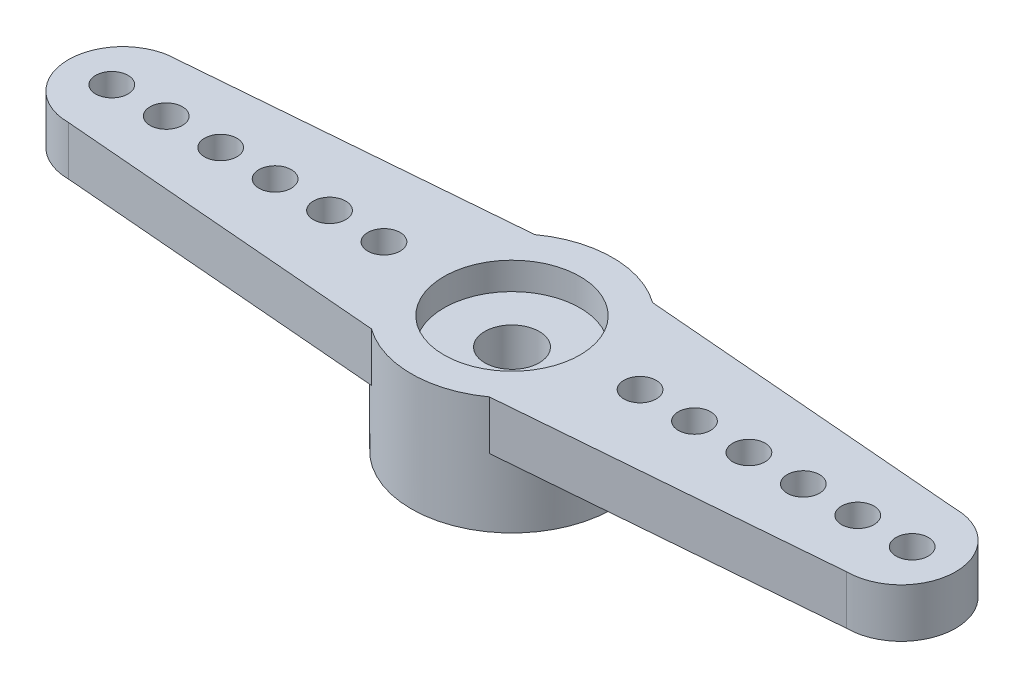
from build123d import *

# Parameters (mm, degrees)
CROQUIS1_R              = 3.7
SALIENTE_EXTRUIR2_DEPTH = 4.3
CROQUIS2_R              = 2.5
CORTAR_EXTRUIR1_DEPTH   = 1.5
CORTAR_EXTRUIR2_START   = -1
CROQUIS3_R              = 2.5
CORTAR_EXTRUIR2_DEPTH   = 1
CROQUIS4_R              = 1
CORTAR_EXTRUIR3_DEPTH   = 1.8
SALIENTE_EXTRUIR3_DEPTH = 1.8
CROQUIS6_R              = 0.595
CORTAR_EXTRUIR4_DEPTH   = 1.8


with BuildPart() as part:
    # Croquis1 → Saliente-Extruir2 (new body)
    with BuildSketch(Plane(origin=(0, 0, 0), x_dir=(1, 0, 0), z_dir=(0, 1, 0))):
        with Locations(Location((0, 0, 0), (0, 0, 90))):
            Circle(CROQUIS1_R)
    extrude(amount=SALIENTE_EXTRUIR2_DEPTH)

    # Croquis2 → Cortar-Extruir1 (cut)
    with BuildSketch(Plane.XZ):
        with Locations(Location((0, 0, 0), (0, 0, 270))):
            Circle(CROQUIS2_R)
    extrude(amount=-CORTAR_EXTRUIR1_DEPTH, mode=Mode.SUBTRACT)

    # Croquis3 → Cortar-Extruir2 (cut)
    with BuildSketch(Plane(origin=(0, 4.3, 0), x_dir=(1, 0, 0), z_dir=(0, 1, 0)).offset(CORTAR_EXTRUIR2_START)):
        with Locations(Location((0, 0, 0), (0, 0, 90))):
            Circle(CROQUIS3_R)
    extrude(amount=CORTAR_EXTRUIR2_DEPTH, mode=Mode.SUBTRACT)

    # Croquis4 → Cortar-Extruir3 (cut)
    with BuildSketch(Plane(origin=(0, 3.3, 0), x_dir=(1, 0, 0), z_dir=(0, 1, 0))):
        with Locations(Location((0, 0, 0), (0, 0, 270))):
            Circle(CROQUIS4_R)
    extrude(amount=-CORTAR_EXTRUIR3_DEPTH, mode=Mode.SUBTRACT)

    # Croquis5 → Saliente-Extruir3 (add)
    with BuildSketch(Plane(origin=(0, 4.3, 0), x_dir=(1, 0, 0), z_dir=(0, 1, 0))):
        with BuildLine():
            Line((-2.16564, 3.000000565), (-3.120237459, 0))
            Line((-3.120237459, 0), (-2.16564, -3.000000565))
            Line((-2.16564, -3.000000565), (-14.3, -2))
            ThreePointArc((-14.3, -2), (-16.3, 0), (-14.3, 2))
            Line((-14.3, 2), (-2.16564, 3.000000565))
        make_face()
        with BuildLine():
            Line((3.120237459, 0), (2.16564, -3.000000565))
            Line((2.16564, -3.000000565), (14.3, -2))
            ThreePointArc((14.3, -2), (16.3, 0), (14.3, 2))
            Line((14.3, 2), (2.16564, 3.000000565))
            Line((2.16564, 3.000000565), (3.120237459, 0))
        make_face()
    extrude(amount=-SALIENTE_EXTRUIR3_DEPTH)

    # Croquis6 → Cortar-Extruir4 (cut)
    with BuildSketch(Plane(origin=(0, 4.3, 0), x_dir=(1, 0, 0), z_dir=(0, 1, 0))):
        with Locations(Location((-14.705, 0, 0), (0, 0, 270))):
            Circle(CROQUIS6_R)
        with Locations(Location((-12.705, 0, 0), (0, 0, 270))):
            Circle(CROQUIS6_R)
        with Locations(Location((-10.705, 0, 0), (0, 0, 270))):
            Circle(CROQUIS6_R)
        with Locations(Location((-8.705, 0, 0), (0, 0, 270))):
            Circle(CROQUIS6_R)
        with Locations(Location((-6.705, 0, 0), (0, 0, 270))):
            Circle(CROQUIS6_R)
        with Locations(Location((-4.705, 0, 0), (0, 0, 270))):
            Circle(CROQUIS6_R)
        with Locations(Location((14.705, 0, 0), (0, 0, 90))):
            Circle(CROQUIS6_R)
        with Locations(Location((12.705, 0, 0), (0, 0, 90))):
            Circle(CROQUIS6_R)
        with Locations(Location((10.705, 0, 0), (0, 0, 90))):
            Circle(CROQUIS6_R)
        with Locations(Location((8.705, 0, 0), (0, 0, 90))):
            Circle(CROQUIS6_R)
        with Locations(Location((6.705, 0, 0), (0, 0, 90))):
            Circle(CROQUIS6_R)
        with Locations(Location((4.705, 0, 0), (0, 0, 90))):
            Circle(CROQUIS6_R)
    extrude(amount=-CORTAR_EXTRUIR4_DEPTH, mode=Mode.SUBTRACT)


solid = part.part
